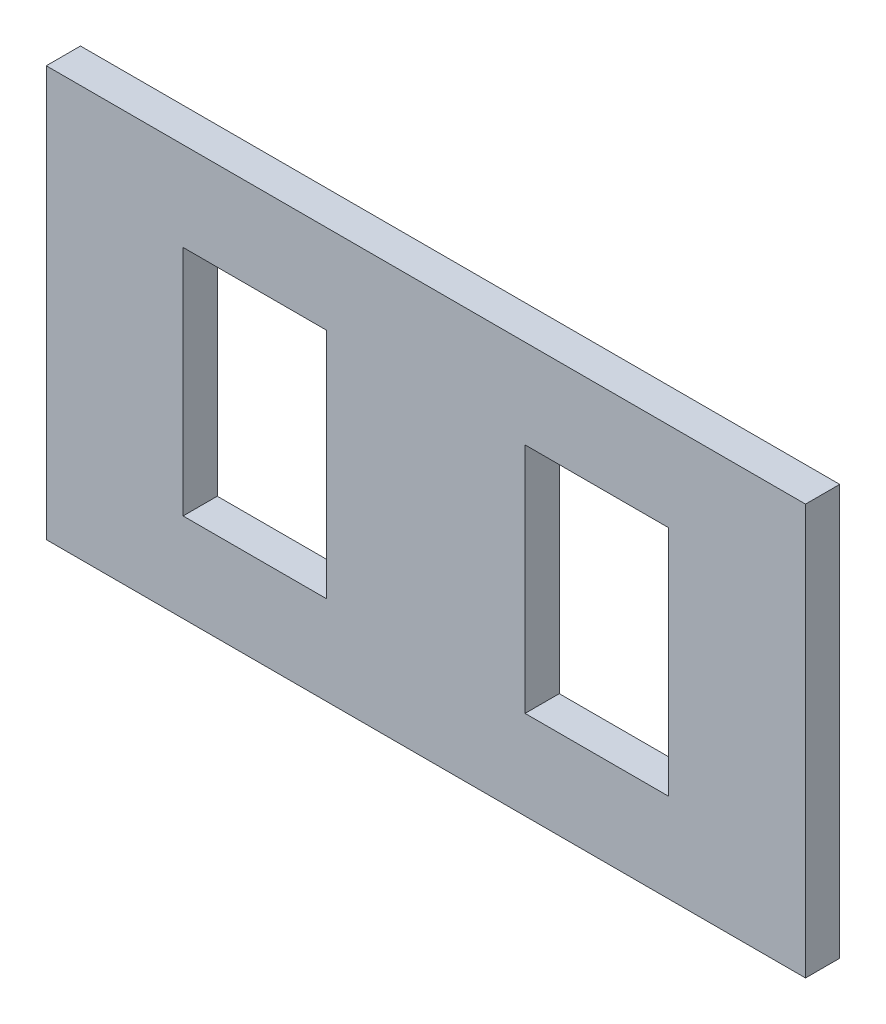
from build123d import *

# Parameters (mm, degrees)
SKETCH_1_W      = 111
SKETCH_1_H      = 60
SKETCH_1_W_2    = 21
SKETCH_1_H_2    = 34
EXTRUDE_1_DEPTH = 5


with BuildPart() as part:
    # Sketch 1 → Extrude 1 (new body)
    with BuildSketch(Plane.XY):
        with Locations((55.5, 30)):
            Rectangle(SKETCH_1_W, SKETCH_1_H)
        with Locations((30.5, 30)):
            Rectangle(SKETCH_1_W_2, SKETCH_1_H_2, mode=Mode.SUBTRACT)
        with Locations((80.5, 30)):
            Rectangle(SKETCH_1_W_2, SKETCH_1_H_2, mode=Mode.SUBTRACT)
    extrude(amount=EXTRUDE_1_DEPTH)


solid = part.part
